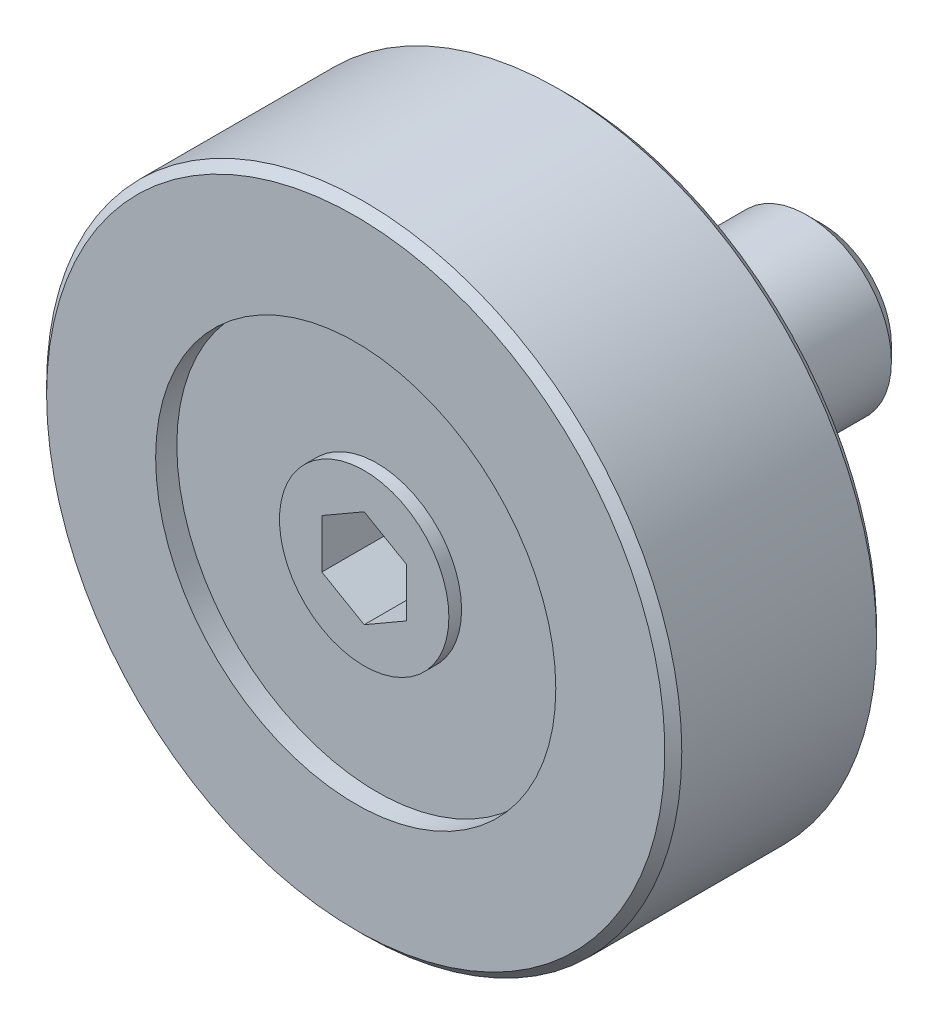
ISO-10303-21;
HEADER;
FILE_DESCRIPTION(('STEP AP214'),'2;1');
FILE_NAME('part.step','',(''),(''),'','','');
FILE_SCHEMA(('AUTOMOTIVE_DESIGN { 1 0 10303 214 1 1 1 1 }'));
ENDSEC;
DATA;
#1=APPLICATION_CONTEXT('core data for automotive mechanical design processes');
#2=APPLICATION_PROTOCOL_DEFINITION('international standard','automotive_design',2000,#1);
#3=PRODUCT_CONTEXT('',#1,'mechanical');
#4=PRODUCT('Part','Part','',(#3));
#5=PRODUCT_RELATED_PRODUCT_CATEGORY('part','',(#4));
#6=PRODUCT_DEFINITION_FORMATION('','',#4);
#7=PRODUCT_DEFINITION_CONTEXT('part definition',#1,'design');
#8=PRODUCT_DEFINITION('design','',#6,#7);
#9=PRODUCT_DEFINITION_SHAPE('','',#8);
#10=(LENGTH_UNIT() NAMED_UNIT(*) SI_UNIT(.MILLI.,.METRE.));
#11=(NAMED_UNIT(*) PLANE_ANGLE_UNIT() SI_UNIT($,.RADIAN.));
#12=(NAMED_UNIT(*) SI_UNIT($,.STERADIAN.) SOLID_ANGLE_UNIT());
#13=UNCERTAINTY_MEASURE_WITH_UNIT(LENGTH_MEASURE(1.E-05),#10,'distance_accuracy_value','');
#14=(GEOMETRIC_REPRESENTATION_CONTEXT(3) GLOBAL_UNCERTAINTY_ASSIGNED_CONTEXT((#13)) GLOBAL_UNIT_ASSIGNED_CONTEXT((#10,
#11,#12)) REPRESENTATION_CONTEXT('',''));
#15=CARTESIAN_POINT('',(0.,0.,0.));
#16=DIRECTION('',(0.,0.,1.));
#17=DIRECTION('',(1.,0.,0.));
#18=AXIS2_PLACEMENT_3D('',#15,#16,#17);
#19=CARTESIAN_POINT('',(0.,6.8,1.00000000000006));
#20=DIRECTION('',(0.,0.,-1.));
#21=DIRECTION('',(-1.,0.,0.));
#22=AXIS2_PLACEMENT_3D('',#19,#20,#21);
#23=PLANE('',#22);
#24=CARTESIAN_POINT('',(0.,0.,1.00000000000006));
#25=DIRECTION('',(0.,0.,1.));
#26=DIRECTION('',(1.,0.,0.));
#27=AXIS2_PLACEMENT_3D('',#24,#25,#26);
#28=CIRCLE('',#27,4.72500000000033);
#29=CARTESIAN_POINT('',(4.72500000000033,0.,1.00000000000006));
#30=VERTEX_POINT('',#29);
#31=EDGE_CURVE('E9',#30,#30,#28,.T.);
#32=ORIENTED_EDGE('',*,*,#31,.T.);
#33=EDGE_LOOP('',(#32));
#34=FACE_BOUND('',#33,.T.);
#35=CARTESIAN_POINT('',(0.,0.,1.00000000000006));
#36=DIRECTION('',(0.,0.,-1.));
#37=DIRECTION('',(-1.,0.,0.));
#38=AXIS2_PLACEMENT_3D('',#35,#36,#37);
#39=CIRCLE('',#38,7.3);
#40=CARTESIAN_POINT('',(-7.3,0.,1.00000000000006));
#41=VERTEX_POINT('',#40);
#42=EDGE_CURVE('E180',#41,#41,#39,.T.);
#43=ORIENTED_EDGE('',*,*,#42,.T.);
#44=EDGE_LOOP('',(#43));
#45=FACE_BOUND('',#44,.T.);
#46=ADVANCED_FACE('F14',(#34,#45),#23,.T.);
#47=CARTESIAN_POINT('',(0.,0.,9.));
#48=DIRECTION('',(0.,0.,1.));
#49=DIRECTION('',(1.,0.,0.));
#50=AXIS2_PLACEMENT_3D('',#47,#48,#49);
#51=CYLINDRICAL_SURFACE('',#50,4.72500000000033);
#52=CARTESIAN_POINT('',(0.,0.,1.5));
#53=DIRECTION('',(0.,0.,1.));
#54=DIRECTION('',(1.,0.,0.));
#55=AXIS2_PLACEMENT_3D('',#52,#53,#54);
#56=CIRCLE('',#55,4.72500000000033);
#57=CARTESIAN_POINT('',(4.72500000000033,0.,1.5));
#58=VERTEX_POINT('',#57);
#59=EDGE_CURVE('E21',#58,#58,#56,.T.);
#60=ORIENTED_EDGE('',*,*,#59,.T.);
#61=EDGE_LOOP('',(#60));
#62=FACE_BOUND('',#61,.T.);
#63=ORIENTED_EDGE('',*,*,#31,.F.);
#64=EDGE_LOOP('',(#63));
#65=FACE_BOUND('',#64,.T.);
#66=ADVANCED_FACE('F156',(#62,#65),#51,.F.);
#67=CARTESIAN_POINT('',(0.,2.99999999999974,1.5));
#68=DIRECTION('',(0.,0.,-1.));
#69=DIRECTION('',(-1.,0.,0.));
#70=AXIS2_PLACEMENT_3D('',#67,#68,#69);
#71=PLANE('',#70);
#72=CARTESIAN_POINT('',(0.,0.,1.5));
#73=DIRECTION('',(0.,0.,1.));
#74=DIRECTION('',(1.,0.,0.));
#75=AXIS2_PLACEMENT_3D('',#72,#73,#74);
#76=CIRCLE('',#75,2.99999999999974);
#77=CARTESIAN_POINT('',(2.99999999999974,0.,1.5));
#78=VERTEX_POINT('',#77);
#79=EDGE_CURVE('E151',#78,#78,#76,.T.);
#80=ORIENTED_EDGE('',*,*,#79,.T.);
#81=EDGE_LOOP('',(#80));
#82=FACE_BOUND('',#81,.T.);
#83=ORIENTED_EDGE('',*,*,#59,.F.);
#84=EDGE_LOOP('',(#83));
#85=FACE_BOUND('',#84,.T.);
#86=ADVANCED_FACE('F159',(#82,#85),#71,.T.);
#87=CARTESIAN_POINT('',(0.,0.,9.));
#88=DIRECTION('',(0.,0.,1.));
#89=DIRECTION('',(1.,0.,0.));
#90=AXIS2_PLACEMENT_3D('',#87,#88,#89);
#91=CYLINDRICAL_SURFACE('',#90,2.99999999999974);
#92=CARTESIAN_POINT('',(0.,0.,0.));
#93=DIRECTION('',(0.,0.,1.));
#94=DIRECTION('',(1.,0.,0.));
#95=AXIS2_PLACEMENT_3D('',#92,#93,#94);
#96=CIRCLE('',#95,2.99999999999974);
#97=CARTESIAN_POINT('',(2.99999999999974,0.,0.));
#98=VERTEX_POINT('',#97);
#99=EDGE_CURVE('E148',#98,#98,#96,.T.);
#100=ORIENTED_EDGE('',*,*,#99,.T.);
#101=EDGE_LOOP('',(#100));
#102=FACE_BOUND('',#101,.T.);
#103=ORIENTED_EDGE('',*,*,#79,.F.);
#104=EDGE_LOOP('',(#103));
#105=FACE_BOUND('',#104,.T.);
#106=ADVANCED_FACE('F161',(#102,#105),#91,.T.);
#107=CARTESIAN_POINT('',(0.,2.99999999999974,0.));
#108=DIRECTION('',(0.,0.,-1.));
#109=DIRECTION('',(-1.,0.,0.));
#110=AXIS2_PLACEMENT_3D('',#107,#108,#109);
#111=PLANE('',#110);
#112=CARTESIAN_POINT('',(0.,0.,0.));
#113=DIRECTION('',(0.,0.,1.));
#114=DIRECTION('',(1.,0.,0.));
#115=AXIS2_PLACEMENT_3D('',#112,#113,#114);
#116=CIRCLE('',#115,1.44999999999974);
#117=CARTESIAN_POINT('',(1.44999999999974,0.,0.));
#118=VERTEX_POINT('',#117);
#119=EDGE_CURVE('E145',#118,#118,#116,.T.);
#120=ORIENTED_EDGE('',*,*,#119,.T.);
#121=EDGE_LOOP('',(#120));
#122=FACE_BOUND('',#121,.T.);
#123=ORIENTED_EDGE('',*,*,#99,.F.);
#124=EDGE_LOOP('',(#123));
#125=FACE_BOUND('',#124,.T.);
#126=ADVANCED_FACE('F169',(#122,#125),#111,.T.);
#127=CARTESIAN_POINT('',(0.,0.,9.));
#128=DIRECTION('',(0.,0.,1.));
#129=DIRECTION('',(1.,0.,0.));
#130=AXIS2_PLACEMENT_3D('',#127,#128,#129);
#131=CYLINDRICAL_SURFACE('',#130,1.44999999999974);
#132=CARTESIAN_POINT('',(0.,0.,-1.));
#133=DIRECTION('',(0.,0.,1.));
#134=DIRECTION('',(1.,0.,0.));
#135=AXIS2_PLACEMENT_3D('',#132,#133,#134);
#136=CIRCLE('',#135,1.44999999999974);
#137=CARTESIAN_POINT('',(1.44999999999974,0.,-1.));
#138=VERTEX_POINT('',#137);
#139=EDGE_CURVE('E142',#138,#138,#136,.T.);
#140=ORIENTED_EDGE('',*,*,#139,.T.);
#141=EDGE_LOOP('',(#140));
#142=FACE_BOUND('',#141,.T.);
#143=ORIENTED_EDGE('',*,*,#119,.F.);
#144=EDGE_LOOP('',(#143));
#145=FACE_BOUND('',#144,.T.);
#146=ADVANCED_FACE('F255',(#142,#145),#131,.T.);
#147=CARTESIAN_POINT('',(0.,1.44999999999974,-1.));
#148=DIRECTION('',(0.,0.,1.));
#149=DIRECTION('',(1.,0.,0.));
#150=AXIS2_PLACEMENT_3D('',#147,#148,#149);
#151=PLANE('',#150);
#152=CARTESIAN_POINT('',(0.,0.,-1.));
#153=DIRECTION('',(0.,0.,1.));
#154=DIRECTION('',(1.,0.,0.));
#155=AXIS2_PLACEMENT_3D('',#152,#153,#154);
#156=CIRCLE('',#155,1.99999999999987);
#157=CARTESIAN_POINT('',(1.99999999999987,0.,-1.));
#158=VERTEX_POINT('',#157);
#159=EDGE_CURVE('E139',#158,#158,#156,.T.);
#160=ORIENTED_EDGE('',*,*,#159,.T.);
#161=EDGE_LOOP('',(#160));
#162=FACE_BOUND('',#161,.T.);
#163=ORIENTED_EDGE('',*,*,#139,.F.);
#164=EDGE_LOOP('',(#163));
#165=FACE_BOUND('',#164,.T.);
#166=ADVANCED_FACE('F251',(#162,#165),#151,.T.);
#167=CARTESIAN_POINT('',(0.,0.,9.));
#168=DIRECTION('',(0.,0.,1.));
#169=DIRECTION('',(1.,0.,0.));
#170=AXIS2_PLACEMENT_3D('',#167,#168,#169);
#171=CYLINDRICAL_SURFACE('',#170,1.99999999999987);
#172=CARTESIAN_POINT('',(0.,0.,-4.65));
#173=DIRECTION('',(0.,0.,1.));
#174=DIRECTION('',(1.,0.,0.));
#175=AXIS2_PLACEMENT_3D('',#172,#173,#174);
#176=CIRCLE('',#175,1.99999999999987);
#177=CARTESIAN_POINT('',(1.99999999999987,0.,-4.65));
#178=VERTEX_POINT('',#177);
#179=EDGE_CURVE('E136',#178,#178,#176,.T.);
#180=ORIENTED_EDGE('',*,*,#179,.T.);
#181=EDGE_LOOP('',(#180));
#182=FACE_BOUND('',#181,.T.);
#183=ORIENTED_EDGE('',*,*,#159,.F.);
#184=EDGE_LOOP('',(#183));
#185=FACE_BOUND('',#184,.T.);
#186=ADVANCED_FACE('F247',(#182,#185),#171,.T.);
#187=CARTESIAN_POINT('',(0.,0.,-4.65));
#188=DIRECTION('',(0.,0.,1.));
#189=DIRECTION('',(1.,0.,0.));
#190=AXIS2_PLACEMENT_3D('',#187,#188,#189);
#191=CONICAL_SURFACE('',#190,1.99999999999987,0.785398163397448);
#192=CARTESIAN_POINT('',(0.,0.,-5.));
#193=DIRECTION('',(0.,0.,1.));
#194=DIRECTION('',(1.,0.,0.));
#195=AXIS2_PLACEMENT_3D('',#192,#193,#194);
#196=CIRCLE('',#195,1.64999999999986);
#197=CARTESIAN_POINT('',(1.64999999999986,0.,-5.));
#198=VERTEX_POINT('',#197);
#199=EDGE_CURVE('E133',#198,#198,#196,.T.);
#200=ORIENTED_EDGE('',*,*,#199,.T.);
#201=EDGE_LOOP('',(#200));
#202=FACE_BOUND('',#201,.T.);
#203=ORIENTED_EDGE('',*,*,#179,.F.);
#204=EDGE_LOOP('',(#203));
#205=FACE_BOUND('',#204,.T.);
#206=ADVANCED_FACE('F243',(#202,#205),#191,.T.);
#207=CARTESIAN_POINT('',(0.,-1.32413961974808E-13,-5.));
#208=DIRECTION('',(0.,0.,-1.));
#209=DIRECTION('',(-1.,0.,0.));
#210=AXIS2_PLACEMENT_3D('',#207,#208,#209);
#211=PLANE('',#210);
#212=ORIENTED_EDGE('',*,*,#199,.F.);
#213=EDGE_LOOP('',(#212));
#214=FACE_BOUND('',#213,.T.);
#215=ADVANCED_FACE('F239',(#214),#211,.T.);
#216=CARTESIAN_POINT('',(0.,0.,5.79999999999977));
#217=DIRECTION('',(0.,0.,-1.));
#218=DIRECTION('',(-1.,0.,0.));
#219=AXIS2_PLACEMENT_3D('',#216,#217,#218);
#220=CONICAL_SURFACE('',#219,7.5,0.785398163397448);
#221=CARTESIAN_POINT('',(0.,0.,5.99999999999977));
#222=DIRECTION('',(0.,0.,-1.));
#223=DIRECTION('',(-1.,0.,0.));
#224=AXIS2_PLACEMENT_3D('',#221,#222,#223);
#225=CIRCLE('',#224,7.3);
#226=CARTESIAN_POINT('',(-7.3,0.,5.99999999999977));
#227=VERTEX_POINT('',#226);
#228=EDGE_CURVE('E103',#227,#227,#225,.T.);
#229=ORIENTED_EDGE('',*,*,#228,.T.);
#230=EDGE_LOOP('',(#229));
#231=FACE_BOUND('',#230,.T.);
#232=CARTESIAN_POINT('',(0.,0.,5.79999999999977));
#233=DIRECTION('',(0.,0.,-1.));
#234=DIRECTION('',(-1.,0.,0.));
#235=AXIS2_PLACEMENT_3D('',#232,#233,#234);
#236=CIRCLE('',#235,7.5);
#237=CARTESIAN_POINT('',(-7.5,0.,5.79999999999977));
#238=VERTEX_POINT('',#237);
#239=EDGE_CURVE('E185',#238,#238,#236,.T.);
#240=ORIENTED_EDGE('',*,*,#239,.F.);
#241=EDGE_LOOP('',(#240));
#242=FACE_BOUND('',#241,.T.);
#243=ADVANCED_FACE('F242',(#231,#242),#220,.T.);
#244=CARTESIAN_POINT('',(0.,0.,1.20000000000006));
#245=DIRECTION('',(0.,0.,-1.));
#246=DIRECTION('',(-1.,0.,0.));
#247=AXIS2_PLACEMENT_3D('',#244,#245,#246);
#248=CYLINDRICAL_SURFACE('',#247,7.5);
#249=ORIENTED_EDGE('',*,*,#239,.T.);
#250=EDGE_LOOP('',(#249));
#251=FACE_BOUND('',#250,.T.);
#252=CARTESIAN_POINT('',(0.,0.,1.20000000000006));
#253=DIRECTION('',(0.,0.,-1.));
#254=DIRECTION('',(-1.,0.,0.));
#255=AXIS2_PLACEMENT_3D('',#252,#253,#254);
#256=CIRCLE('',#255,7.5);
#257=CARTESIAN_POINT('',(-7.5,0.,1.20000000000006));
#258=VERTEX_POINT('',#257);
#259=EDGE_CURVE('E182',#258,#258,#256,.T.);
#260=ORIENTED_EDGE('',*,*,#259,.F.);
#261=EDGE_LOOP('',(#260));
#262=FACE_BOUND('',#261,.T.);
#263=ADVANCED_FACE('F306',(#251,#262),#248,.T.);
#264=CARTESIAN_POINT('',(0.,0.,1.00000000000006));
#265=DIRECTION('',(0.,0.,1.));
#266=DIRECTION('',(1.,0.,0.));
#267=AXIS2_PLACEMENT_3D('',#264,#265,#266);
#268=CONICAL_SURFACE('',#267,7.3,0.785398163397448);
#269=ORIENTED_EDGE('',*,*,#259,.T.);
#270=EDGE_LOOP('',(#269));
#271=FACE_BOUND('',#270,.T.);
#272=ORIENTED_EDGE('',*,*,#42,.F.);
#273=EDGE_LOOP('',(#272));
#274=FACE_BOUND('',#273,.T.);
#275=ADVANCED_FACE('F314',(#271,#274),#268,.T.);
#276=CARTESIAN_POINT('',(0.,0.,4.19999999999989));
#277=DIRECTION('',(0.,0.,1.));
#278=DIRECTION('',(1.,0.,0.));
#279=AXIS2_PLACEMENT_3D('',#276,#277,#278);
#280=PLANE('',#279);
#281=DIRECTION('',(-0.866025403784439,0.5,0.));
#282=VECTOR('',#281,1.);
#283=CARTESIAN_POINT('',(1.,0.577350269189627,4.19999999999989));
#284=LINE('',#283,#282);
#285=CARTESIAN_POINT('',(1.,0.577350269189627,4.19999999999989));
#286=VERTEX_POINT('',#285);
#287=CARTESIAN_POINT('',(0.,1.15470053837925,4.19999999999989));
#288=VERTEX_POINT('',#287);
#289=EDGE_CURVE('E114',#286,#288,#284,.T.);
#290=ORIENTED_EDGE('',*,*,#289,.T.);
#291=DIRECTION('',(-0.866025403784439,-0.5,0.));
#292=VECTOR('',#291,1.);
#293=CARTESIAN_POINT('',(0.,1.15470053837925,4.19999999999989));
#294=LINE('',#293,#292);
#295=CARTESIAN_POINT('',(-1.,0.577350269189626,4.19999999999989));
#296=VERTEX_POINT('',#295);
#297=EDGE_CURVE('E96',#288,#296,#294,.T.);
#298=ORIENTED_EDGE('',*,*,#297,.T.);
#299=DIRECTION('',(0.,-1.,0.));
#300=VECTOR('',#299,1.);
#301=CARTESIAN_POINT('',(-1.,0.577350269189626,4.19999999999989));
#302=LINE('',#301,#300);
#303=CARTESIAN_POINT('',(-1.,-0.577350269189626,4.19999999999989));
#304=VERTEX_POINT('',#303);
#305=EDGE_CURVE('E94',#296,#304,#302,.T.);
#306=ORIENTED_EDGE('',*,*,#305,.T.);
#307=DIRECTION('',(0.866025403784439,-0.5,0.));
#308=VECTOR('',#307,1.);
#309=CARTESIAN_POINT('',(-1.,-0.577350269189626,4.19999999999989));
#310=LINE('',#309,#308);
#311=CARTESIAN_POINT('',(0.,-1.15470053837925,4.19999999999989));
#312=VERTEX_POINT('',#311);
#313=EDGE_CURVE('E73',#304,#312,#310,.T.);
#314=ORIENTED_EDGE('',*,*,#313,.T.);
#315=DIRECTION('',(0.866025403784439,0.5,0.));
#316=VECTOR('',#315,1.);
#317=CARTESIAN_POINT('',(0.,-1.15470053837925,4.19999999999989));
#318=LINE('',#317,#316);
#319=CARTESIAN_POINT('',(1.,-0.577350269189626,4.19999999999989));
#320=VERTEX_POINT('',#319);
#321=EDGE_CURVE('E84',#312,#320,#318,.T.);
#322=ORIENTED_EDGE('',*,*,#321,.T.);
#323=DIRECTION('',(0.,1.,0.));
#324=VECTOR('',#323,1.);
#325=CARTESIAN_POINT('',(1.,-0.577350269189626,4.19999999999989));
#326=LINE('',#325,#324);
#327=EDGE_CURVE('E88',#320,#286,#326,.T.);
#328=ORIENTED_EDGE('',*,*,#327,.T.);
#329=EDGE_LOOP('',(#290,#298,#306,#314,#322,#328));
#330=FACE_BOUND('',#329,.T.);
#331=ADVANCED_FACE('F91',(#330),#280,.T.);
#332=CARTESIAN_POINT('',(0.,1.15470053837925,4.19999999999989));
#333=DIRECTION('',(-0.5,0.866025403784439,0.));
#334=DIRECTION('',(-0.866025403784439,-0.5,0.));
#335=AXIS2_PLACEMENT_3D('',#332,#333,#334);
#336=PLANE('',#335);
#337=DIRECTION('',(-0.866025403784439,-0.5,0.));
#338=VECTOR('',#337,1.);
#339=CARTESIAN_POINT('',(0.,1.15470053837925,5.79999999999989));
#340=LINE('',#339,#338);
#341=CARTESIAN_POINT('',(0.,1.15470053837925,5.79999999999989));
#342=VERTEX_POINT('',#341);
#343=CARTESIAN_POINT('',(-1.,0.577350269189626,5.79999999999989));
#344=VERTEX_POINT('',#343);
#345=EDGE_CURVE('E102',#342,#344,#340,.T.);
#346=ORIENTED_EDGE('',*,*,#345,.T.);
#347=DIRECTION('',(0.,0.,1.));
#348=VECTOR('',#347,1.);
#349=CARTESIAN_POINT('',(-1.,0.577350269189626,4.19999999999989));
#350=LINE('',#349,#348);
#351=EDGE_CURVE('E119',#296,#344,#350,.T.);
#352=ORIENTED_EDGE('',*,*,#351,.F.);
#353=ORIENTED_EDGE('',*,*,#297,.F.);
#354=DIRECTION('',(0.,0.,1.));
#355=VECTOR('',#354,1.);
#356=CARTESIAN_POINT('',(0.,1.15470053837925,4.19999999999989));
#357=LINE('',#356,#355);
#358=EDGE_CURVE('E58',#288,#342,#357,.T.);
#359=ORIENTED_EDGE('',*,*,#358,.T.);
#360=EDGE_LOOP('',(#346,#352,#353,#359));
#361=FACE_BOUND('',#360,.T.);
#362=ADVANCED_FACE('F193',(#361),#336,.F.);
#363=CARTESIAN_POINT('',(-1.,0.577350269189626,4.19999999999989));
#364=DIRECTION('',(-1.,0.,0.));
#365=DIRECTION('',(0.,-1.,0.));
#366=AXIS2_PLACEMENT_3D('',#363,#364,#365);
#367=PLANE('',#366);
#368=DIRECTION('',(0.,-1.,0.));
#369=VECTOR('',#368,1.);
#370=CARTESIAN_POINT('',(-1.,0.577350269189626,5.79999999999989));
#371=LINE('',#370,#369);
#372=CARTESIAN_POINT('',(-1.,-0.577350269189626,5.79999999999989));
#373=VERTEX_POINT('',#372);
#374=EDGE_CURVE('E106',#344,#373,#371,.T.);
#375=ORIENTED_EDGE('',*,*,#374,.T.);
#376=DIRECTION('',(0.,0.,1.));
#377=VECTOR('',#376,1.);
#378=CARTESIAN_POINT('',(-1.,-0.577350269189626,4.19999999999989));
#379=LINE('',#378,#377);
#380=EDGE_CURVE('E81',#304,#373,#379,.T.);
#381=ORIENTED_EDGE('',*,*,#380,.F.);
#382=ORIENTED_EDGE('',*,*,#305,.F.);
#383=ORIENTED_EDGE('',*,*,#351,.T.);
#384=EDGE_LOOP('',(#375,#381,#382,#383));
#385=FACE_BOUND('',#384,.T.);
#386=ADVANCED_FACE('F197',(#385),#367,.F.);
#387=CARTESIAN_POINT('',(-1.,-0.577350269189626,4.19999999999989));
#388=DIRECTION('',(-0.5,-0.866025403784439,0.));
#389=DIRECTION('',(0.866025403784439,-0.5,0.));
#390=AXIS2_PLACEMENT_3D('',#387,#388,#389);
#391=PLANE('',#390);
#392=DIRECTION('',(0.866025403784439,-0.5,0.));
#393=VECTOR('',#392,1.);
#394=CARTESIAN_POINT('',(-1.,-0.577350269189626,5.79999999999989));
#395=LINE('',#394,#393);
#396=CARTESIAN_POINT('',(0.,-1.15470053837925,5.79999999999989));
#397=VERTEX_POINT('',#396);
#398=EDGE_CURVE('E76',#373,#397,#395,.T.);
#399=ORIENTED_EDGE('',*,*,#398,.T.);
#400=DIRECTION('',(0.,0.,1.));
#401=VECTOR('',#400,1.);
#402=CARTESIAN_POINT('',(0.,-1.15470053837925,4.19999999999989));
#403=LINE('',#402,#401);
#404=EDGE_CURVE('E69',#312,#397,#403,.T.);
#405=ORIENTED_EDGE('',*,*,#404,.F.);
#406=ORIENTED_EDGE('',*,*,#313,.F.);
#407=ORIENTED_EDGE('',*,*,#380,.T.);
#408=EDGE_LOOP('',(#399,#405,#406,#407));
#409=FACE_BOUND('',#408,.T.);
#410=ADVANCED_FACE('F71',(#409),#391,.F.);
#411=CARTESIAN_POINT('',(0.,-1.15470053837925,4.19999999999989));
#412=DIRECTION('',(0.5,-0.866025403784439,0.));
#413=DIRECTION('',(0.866025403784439,0.5,0.));
#414=AXIS2_PLACEMENT_3D('',#411,#412,#413);
#415=PLANE('',#414);
#416=DIRECTION('',(0.866025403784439,0.5,0.));
#417=VECTOR('',#416,1.);
#418=CARTESIAN_POINT('',(0.,-1.15470053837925,5.79999999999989));
#419=LINE('',#418,#417);
#420=CARTESIAN_POINT('',(1.,-0.577350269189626,5.79999999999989));
#421=VERTEX_POINT('',#420);
#422=EDGE_CURVE('E110',#397,#421,#419,.T.);
#423=ORIENTED_EDGE('',*,*,#422,.T.);
#424=DIRECTION('',(0.,0.,1.));
#425=VECTOR('',#424,1.);
#426=CARTESIAN_POINT('',(1.,-0.577350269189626,4.19999999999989));
#427=LINE('',#426,#425);
#428=EDGE_CURVE('E80',#320,#421,#427,.T.);
#429=ORIENTED_EDGE('',*,*,#428,.F.);
#430=ORIENTED_EDGE('',*,*,#321,.F.);
#431=ORIENTED_EDGE('',*,*,#404,.T.);
#432=EDGE_LOOP('',(#423,#429,#430,#431));
#433=FACE_BOUND('',#432,.T.);
#434=ADVANCED_FACE('F85',(#433),#415,.F.);
#435=CARTESIAN_POINT('',(1.,-0.577350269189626,4.19999999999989));
#436=DIRECTION('',(1.,0.,0.));
#437=DIRECTION('',(0.,0.,-1.));
#438=AXIS2_PLACEMENT_3D('',#435,#436,#437);
#439=PLANE('',#438);
#440=DIRECTION('',(0.,1.,0.));
#441=VECTOR('',#440,1.);
#442=CARTESIAN_POINT('',(1.,-0.577350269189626,5.79999999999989));
#443=LINE('',#442,#441);
#444=CARTESIAN_POINT('',(1.,0.577350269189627,5.79999999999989));
#445=VERTEX_POINT('',#444);
#446=EDGE_CURVE('E112',#421,#445,#443,.T.);
#447=ORIENTED_EDGE('',*,*,#446,.T.);
#448=DIRECTION('',(0.,0.,1.));
#449=VECTOR('',#448,1.);
#450=CARTESIAN_POINT('',(1.,0.577350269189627,4.19999999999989));
#451=LINE('',#450,#449);
#452=EDGE_CURVE('E36',#286,#445,#451,.T.);
#453=ORIENTED_EDGE('',*,*,#452,.F.);
#454=ORIENTED_EDGE('',*,*,#327,.F.);
#455=ORIENTED_EDGE('',*,*,#428,.T.);
#456=EDGE_LOOP('',(#447,#453,#454,#455));
#457=FACE_BOUND('',#456,.T.);
#458=ADVANCED_FACE('F202',(#457),#439,.F.);
#459=CARTESIAN_POINT('',(1.,0.577350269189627,4.19999999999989));
#460=DIRECTION('',(0.5,0.866025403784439,0.));
#461=DIRECTION('',(-0.866025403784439,0.5,0.));
#462=AXIS2_PLACEMENT_3D('',#459,#460,#461);
#463=PLANE('',#462);
#464=DIRECTION('',(-0.866025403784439,0.5,0.));
#465=VECTOR('',#464,1.);
#466=CARTESIAN_POINT('',(1.,0.577350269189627,5.79999999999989));
#467=LINE('',#466,#465);
#468=EDGE_CURVE('E28',#445,#342,#467,.T.);
#469=ORIENTED_EDGE('',*,*,#468,.T.);
#470=ORIENTED_EDGE('',*,*,#358,.F.);
#471=ORIENTED_EDGE('',*,*,#289,.F.);
#472=ORIENTED_EDGE('',*,*,#452,.T.);
#473=EDGE_LOOP('',(#469,#470,#471,#472));
#474=FACE_BOUND('',#473,.T.);
#475=ADVANCED_FACE('F204',(#474),#463,.F.);
#476=CARTESIAN_POINT('',(0.,2.,5.79999999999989));
#477=DIRECTION('',(0.,0.,1.));
#478=DIRECTION('',(1.,0.,0.));
#479=AXIS2_PLACEMENT_3D('',#476,#477,#478);
#480=PLANE('',#479);
#481=ORIENTED_EDGE('',*,*,#468,.F.);
#482=ORIENTED_EDGE('',*,*,#446,.F.);
#483=ORIENTED_EDGE('',*,*,#422,.F.);
#484=ORIENTED_EDGE('',*,*,#398,.F.);
#485=ORIENTED_EDGE('',*,*,#374,.F.);
#486=ORIENTED_EDGE('',*,*,#345,.F.);
#487=EDGE_LOOP('',(#481,#482,#483,#484,#485,#486));
#488=FACE_BOUND('',#487,.T.);
#489=CARTESIAN_POINT('',(0.,0.,5.79999999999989));
#490=DIRECTION('',(0.,0.,1.));
#491=DIRECTION('',(1.,0.,0.));
#492=AXIS2_PLACEMENT_3D('',#489,#490,#491);
#493=CIRCLE('',#492,2.);
#494=CARTESIAN_POINT('',(2.,0.,5.79999999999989));
#495=VERTEX_POINT('',#494);
#496=EDGE_CURVE('E130',#495,#495,#493,.T.);
#497=ORIENTED_EDGE('',*,*,#496,.T.);
#498=EDGE_LOOP('',(#497));
#499=FACE_BOUND('',#498,.T.);
#500=ADVANCED_FACE('F199',(#488,#499),#480,.T.);
#501=CARTESIAN_POINT('',(0.,0.,9.));
#502=DIRECTION('',(0.,0.,1.));
#503=DIRECTION('',(1.,0.,0.));
#504=AXIS2_PLACEMENT_3D('',#501,#502,#503);
#505=CYLINDRICAL_SURFACE('',#504,2.);
#506=CARTESIAN_POINT('',(0.,0.,5.49999999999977));
#507=DIRECTION('',(0.,0.,1.));
#508=DIRECTION('',(1.,0.,0.));
#509=AXIS2_PLACEMENT_3D('',#506,#507,#508);
#510=CIRCLE('',#509,2.);
#511=CARTESIAN_POINT('',(2.,0.,5.49999999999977));
#512=VERTEX_POINT('',#511);
#513=EDGE_CURVE('E127',#512,#512,#510,.T.);
#514=ORIENTED_EDGE('',*,*,#513,.T.);
#515=EDGE_LOOP('',(#514));
#516=FACE_BOUND('',#515,.T.);
#517=ORIENTED_EDGE('',*,*,#496,.F.);
#518=EDGE_LOOP('',(#517));
#519=FACE_BOUND('',#518,.T.);
#520=ADVANCED_FACE('F232',(#516,#519),#505,.T.);
#521=CARTESIAN_POINT('',(0.,4.725,5.49999999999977));
#522=DIRECTION('',(0.,0.,1.));
#523=DIRECTION('',(1.,0.,0.));
#524=AXIS2_PLACEMENT_3D('',#521,#522,#523);
#525=PLANE('',#524);
#526=CARTESIAN_POINT('',(0.,0.,5.49999999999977));
#527=DIRECTION('',(0.,0.,1.));
#528=DIRECTION('',(1.,0.,0.));
#529=AXIS2_PLACEMENT_3D('',#526,#527,#528);
#530=CIRCLE('',#529,4.725);
#531=CARTESIAN_POINT('',(4.725,0.,5.49999999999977));
#532=VERTEX_POINT('',#531);
#533=EDGE_CURVE('E124',#532,#532,#530,.T.);
#534=ORIENTED_EDGE('',*,*,#533,.T.);
#535=EDGE_LOOP('',(#534));
#536=FACE_BOUND('',#535,.T.);
#537=ORIENTED_EDGE('',*,*,#513,.F.);
#538=EDGE_LOOP('',(#537));
#539=FACE_BOUND('',#538,.T.);
#540=ADVANCED_FACE('F228',(#536,#539),#525,.T.);
#541=CARTESIAN_POINT('',(0.,0.,9.));
#542=DIRECTION('',(0.,0.,1.));
#543=DIRECTION('',(1.,0.,0.));
#544=AXIS2_PLACEMENT_3D('',#541,#542,#543);
#545=CYLINDRICAL_SURFACE('',#544,4.725);
#546=CARTESIAN_POINT('',(0.,0.,5.99999999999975));
#547=DIRECTION('',(0.,0.,1.));
#548=DIRECTION('',(1.,0.,0.));
#549=AXIS2_PLACEMENT_3D('',#546,#547,#548);
#550=CIRCLE('',#549,4.725);
#551=CARTESIAN_POINT('',(4.725,0.,5.99999999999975));
#552=VERTEX_POINT('',#551);
#553=EDGE_CURVE('E116',#552,#552,#550,.T.);
#554=ORIENTED_EDGE('',*,*,#553,.T.);
#555=EDGE_LOOP('',(#554));
#556=FACE_BOUND('',#555,.T.);
#557=ORIENTED_EDGE('',*,*,#533,.F.);
#558=EDGE_LOOP('',(#557));
#559=FACE_BOUND('',#558,.T.);
#560=ADVANCED_FACE('F224',(#556,#559),#545,.F.);
#561=CARTESIAN_POINT('',(0.,6.8,5.99999999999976));
#562=DIRECTION('',(0.,0.,1.));
#563=DIRECTION('',(1.,0.,0.));
#564=AXIS2_PLACEMENT_3D('',#561,#562,#563);
#565=PLANE('',#564);
#566=ORIENTED_EDGE('',*,*,#228,.F.);
#567=EDGE_LOOP('',(#566));
#568=FACE_BOUND('',#567,.T.);
#569=ORIENTED_EDGE('',*,*,#553,.F.);
#570=EDGE_LOOP('',(#569));
#571=FACE_BOUND('',#570,.T.);
#572=ADVANCED_FACE('F221',(#568,#571),#565,.T.);
#573=CLOSED_SHELL('',(#46,#66,#86,#106,#126,#146,#166,#186,#206,#215,#243,#263,#275,#331,#362,
#386,#410,#434,#458,#475,#500,#520,#540,#560,#572));
#574=MANIFOLD_SOLID_BREP('B1',#573);
#575=ADVANCED_BREP_SHAPE_REPRESENTATION('',(#18,#574),#14);
#576=SHAPE_DEFINITION_REPRESENTATION(#9,#575);
ENDSEC;
END-ISO-10303-21;
